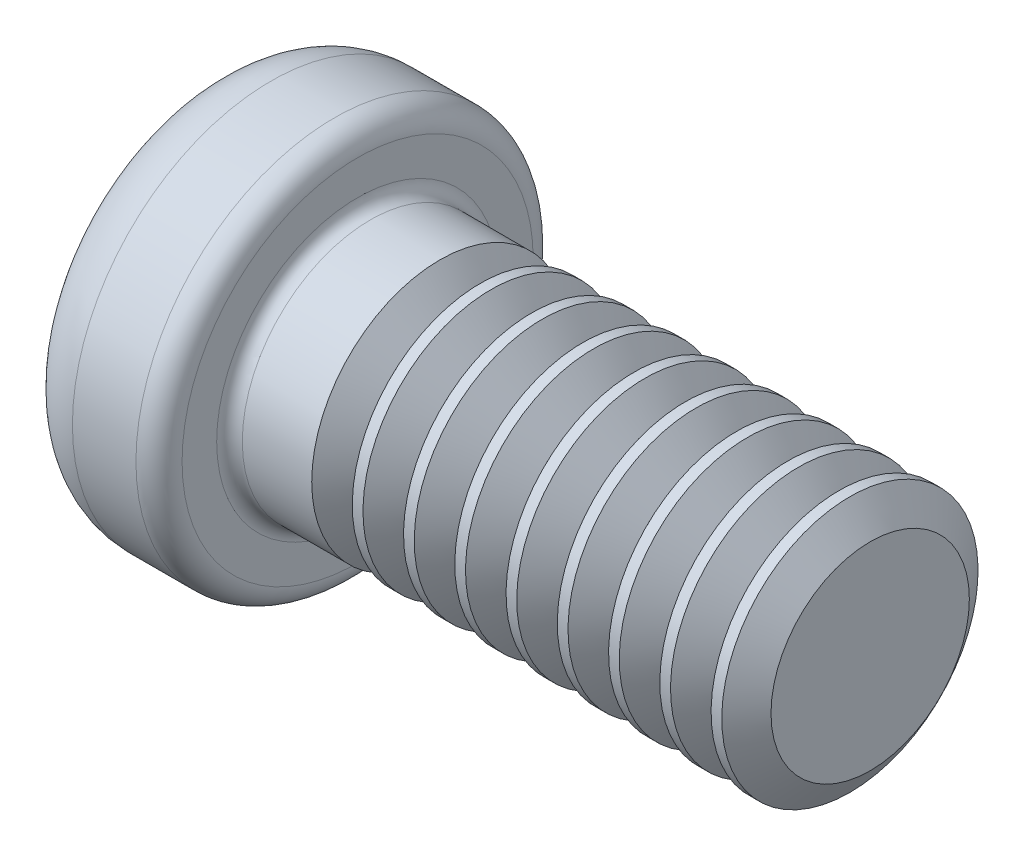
from build123d import *

# Parameters (mm, degrees)
FILLET1_R       = 0.1
RECPAT_COUNT    = 2
RECPAT_ANGLE    = 90
THDSCHPAT_COUNT = 9
THDSCHPAT_PITCH = 0.4


with BuildPart() as part:
    # BodySke → Base-Revolve (revolve)
    with BuildSketch(Plane.XY, mode=Mode.PRIVATE) as base_revolve_sk:
        with BuildLine():
            Line((1.3, 1), (1.3, 1.37))
            ThreePointArc((1.3, 1.37), (1.247279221, 1.497279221), (1.12, 1.55))
            Line((1.12, 1.55), (0.624214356, 1.55))
            ThreePointArc((0.624214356, 1.55), (0.314644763, 1.442640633), (0.138015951, 1.166666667))
            ThreePointArc((0.138015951, 1.166666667), (0.034623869, 0.587400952), (0, 0))
            Line((0, 0), (5.3, 0))
            Line((5.3, 0), (5.3, 1))
            Line((5.3, 1), (1.3, 1))
        make_face()
    revolve(base_revolve_sk.sketch.rotate(Axis((0.624214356, 0, 0), (1, 0, 0)), 90), axis=Axis((0.624214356, 0, 0), (1, 0, 0)))

    # Fillet1
    fillet1_edges = [part.edges().sort_by_distance(p)[0] for p in [
        (1.3, 0, -1),
    ]]
    fillet(fillet1_edges, radius=FILLET1_R)

    # Sketch3 → Recess section 0
    with BuildSketch(Plane(origin=(0, 0, 0), x_dir=(0, 0, -1), z_dir=(1, 0, 0))):
        with BuildLine():
            Line((0.24, -1.05), (-0.24, -1.05))
            Line((-0.24, -1.05), (-0.24, 1.05))
            Line((-0.24, 1.05), (0.24, 1.05))
            Line((0.24, 1.05), (0.24, -1.05))
        make_face()
    # Sketch4 → Recess section 1
    with BuildSketch(Plane(origin=(1.42, 0, 0), x_dir=(0, 0, -1), z_dir=(1, 0, 0))):
        with BuildLine():
            Line((0.24, -0.342014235), (-0.24, -0.342014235))
            Line((-0.24, -0.342014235), (-0.24, 0.342014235))
            Line((-0.24, 0.342014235), (0.24, 0.342014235))
            Line((0.24, 0.342014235), (0.24, -0.342014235))
        make_face()
    recess = loft(mode=Mode.SUBTRACT)

    # RecPat: Recess ×2 about axis
    recpat_axis = Axis((0, 0, 0), (1, 0, 0))
    for i in range(1, RECPAT_COUNT):
        add(recess.rotate(recpat_axis, i * RECPAT_ANGLE / (RECPAT_COUNT - 1)), mode=Mode.SUBTRACT)

    # RecCorSke → RecessCore (revolve, cut)
    with BuildSketch(Plane.XY, mode=Mode.PRIVATE) as recesscore_sk:
        Polygon((0, 0), (0, 0.454796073), (1.42, 0.3555), (1.535508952, 0), align=None)
    revolve(recesscore_sk.sketch.rotate(Axis((-3.175, 0, 0), (1, 0, 0)), 13.534785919), axis=Axis((-3.175, 0, 0), (1, 0, 0)), mode=Mode.SUBTRACT)

    # ThdSchSke → ThreadSchematic (revolve, cut)
    with BuildSketch(Plane.XY, mode=Mode.PRIVATE) as threadschematic_sk:
        Polygon((2.1, -0.774), (1.941753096, -1), (1.941753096, -1.25), (2.258246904, -1.25), (2.258246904, -1), align=None)
    threadschematic = revolve(threadschematic_sk.sketch.rotate(Axis((-3.175, 0, 0), (1, 0, 0)), 270), axis=Axis((-3.175, 0, 0), (1, 0, 0)), mode=Mode.SUBTRACT)

    # ThdSchPat: ThreadSchematic ×9
    with Locations(*[(i * THDSCHPAT_PITCH, 0, 0) for i in range(1, THDSCHPAT_COUNT)]):
        add(threadschematic, mode=Mode.SUBTRACT)


solid = part.part
